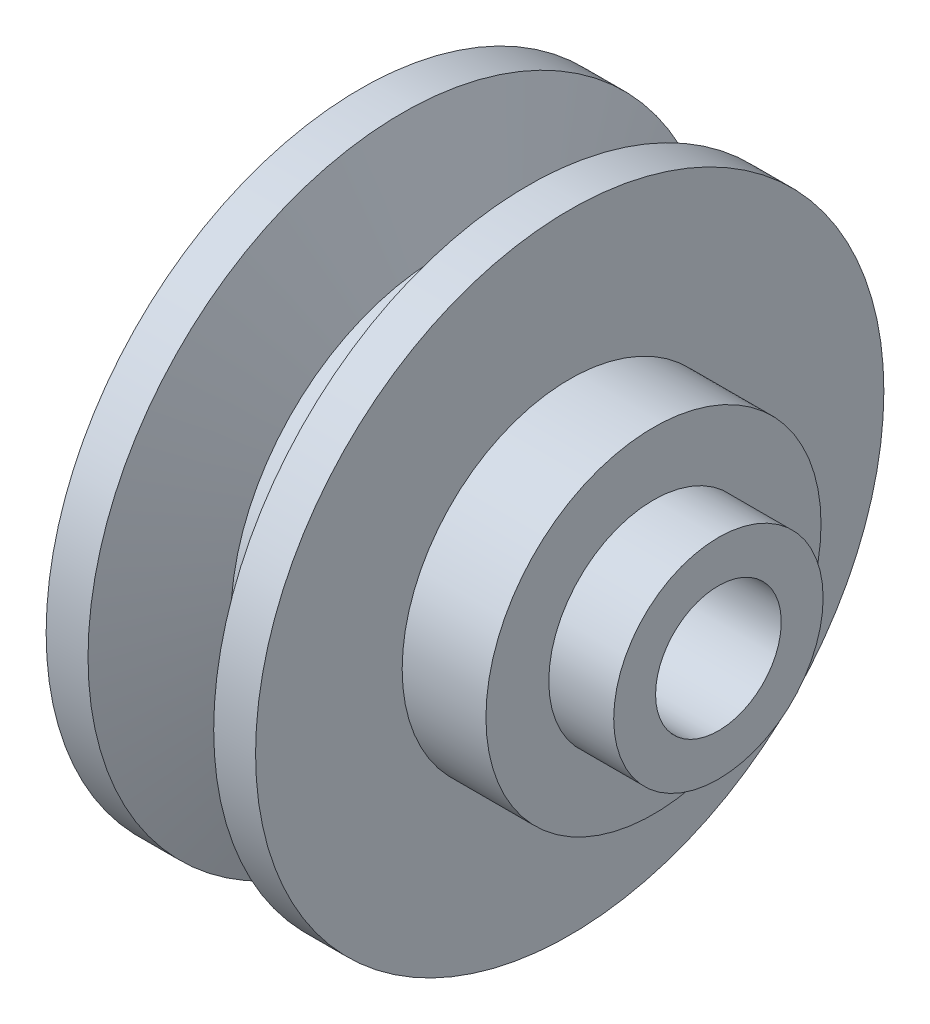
from build123d import *


with BuildPart() as part:
    # Sketch1 → Revolve1 (revolve)
    with BuildSketch(Plane(origin=(0, 0, 0), x_dir=(1, 0, 0), z_dir=(0, 1, 0)), mode=Mode.PRIVATE) as revolve1_sk:
        Polygon((3.819851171, 10), (6.180148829, 10), (8, 15), (10, 15), (10, 8), (14, 8), (14, 5), (17.1, 5), (17.1, 3), (3.4, 3), (0, 6.4), (0, 15), (2, 15), align=None)
    revolve(revolve1_sk.sketch.rotate(Axis((0, 0, 0), (1, 0, 0)), 180), axis=Axis((0, 0, 0), (1, 0, 0)))


solid = part.part
